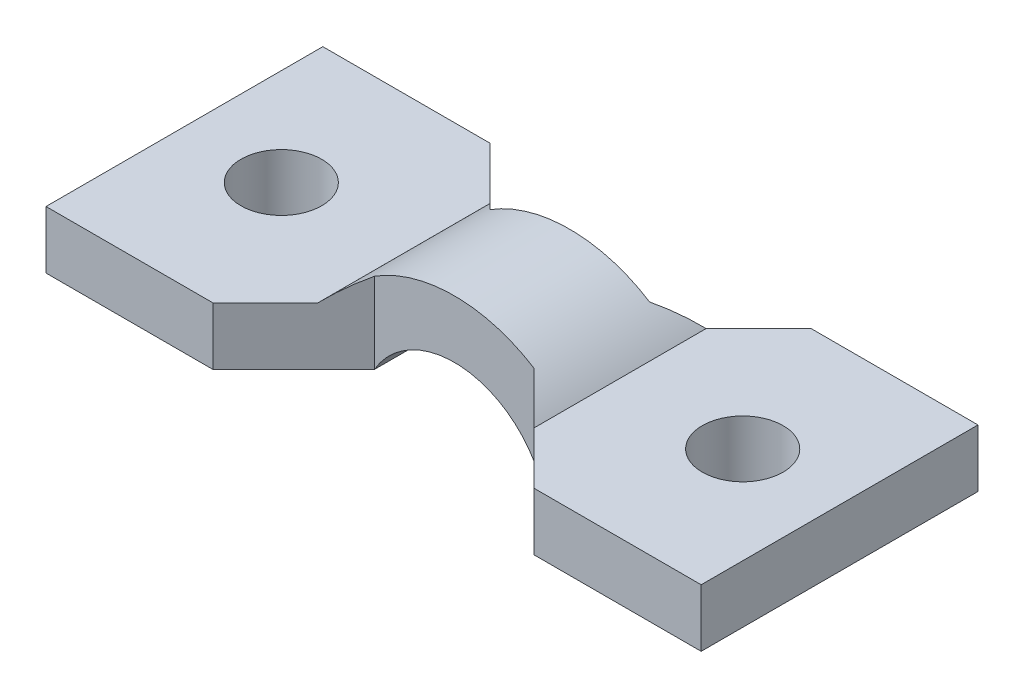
from build123d import *

# Parameters (mm, degrees)
BOSS_EXTRUDE1_DEPTH = 12
SKETCH2_R           = 1.75
CUT_EXTRUDE1_DEPTH  = 19.7587313
SKETCH4_W           = 6.92820323
SKETCH4_H           = 3.5
CUT_EXTRUDE2_DEPTH  = 20.128251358


with BuildPart() as part:
    # Sketch1 → Boss-Extrude1 (new body)
    with BuildSketch(Plane.XY):
        with BuildLine():
            Line((-3.464101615, 2), (-14.2, 2))
            Line((-14.2, 2), (-14.2, 4.5))
            Line((-14.2, 4.5), (-4.69041576, 4.5))
            ThreePointArc((-4.69041576, 4.5), (0, 6.5), (4.69041576, 4.5))
            Line((4.69041576, 4.5), (14.2, 4.5))
            Line((14.2, 4.5), (14.2, 2))
            Line((14.2, 2), (3.464101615, 2))
            ThreePointArc((3.464101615, 2), (0, 4), (-3.464101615, 2))
        make_face()
    extrude(amount=BOSS_EXTRUDE1_DEPTH)

    # Sketch2 → Cut-Extrude1 (cut, through all)
    with BuildSketch(Plane(origin=(0, 4.5, 0), x_dir=(1, 0, 0), z_dir=(0, 1, 0))):
        with Locations(Location((-10, -6, 0), (0, 0, 270))):
            Circle(SKETCH2_R)
        with Locations(Location((10, -6, 0), (0, 0, 270))):
            Circle(SKETCH2_R)
    extrude(amount=-CUT_EXTRUDE1_DEPTH, mode=Mode.SUBTRACT)

    # Sketch4 → Cut-Extrude2 (cut, through all)
    with BuildSketch(Plane.XZ.offset(-2)):
        Polygon((6.964101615, 0), (3.464101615, 0), (3.464101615, 3.5), align=None)
        with Locations((0, 1.75)):
            Rectangle(SKETCH4_W, SKETCH4_H)
        Polygon((-3.464101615, 0), (-3.464101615, 3.5), (-6.964101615, 0), align=None)
        Polygon((-3.464101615, 8.5), (-3.464101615, 12), (-6.964101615, 12), align=None)
        with Locations((0, 10.25)):
            Rectangle(SKETCH4_W, SKETCH4_H)
        Polygon((3.464101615, 8.5), (6.964101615, 12), (3.464101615, 12), align=None)
    extrude(amount=-CUT_EXTRUDE2_DEPTH, mode=Mode.SUBTRACT)


solid = part.part
